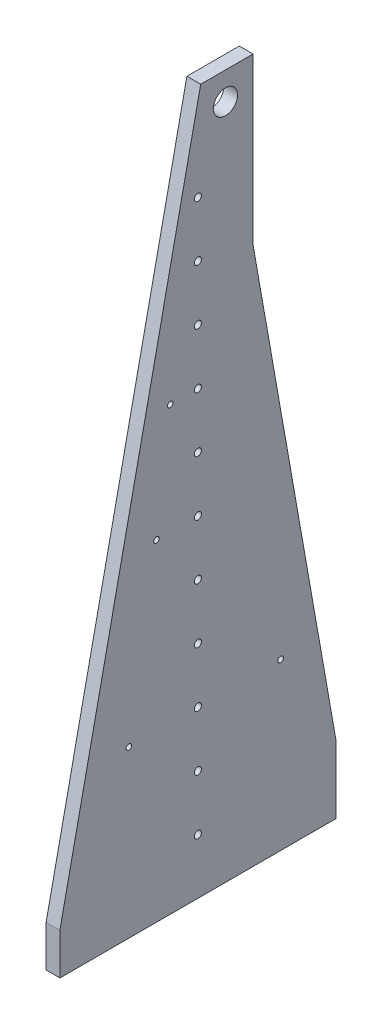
from build123d import *

# Parameters (mm, degrees)
BOSS_EXTRUDE1_DEPTH                              = 12.7
F_7_8_0_875_DIAMETER_HOLE1_D                     = 22.225
F_1_4_20_TAPPED_HOLE2_D                          = 5.1054
F_1_4_20_TAPPED_HOLE1_D                          = 5.1054
F_1_4_20_TAPPED_HOLE1_DEPTH                      = 13.335
F_1_4_20_TAPPED_HOLE1_TIP                        = 1.533816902
CBORE_FOR_1_4_SOCKET_HEAD_CAP_SCREW1_D           = 6.5278
CBORE_FOR_1_4_SOCKET_HEAD_CAP_SCREW1_CBORE_D     = 11.1125
CBORE_FOR_1_4_SOCKET_HEAD_CAP_SCREW1_CBORE_DEPTH = 6.35
LPATTERN1_COUNT                                  = 11
LPATTERN1_PITCH                                  = 50.8
FILLET1_R                                        = 9.652


with BuildPart() as part:
    # Sketch1 → Boss-Extrude1 (new body)
    with BuildSketch(Plane(origin=(0, 0, 0), x_dir=(0, 0, -1), z_dir=(1, 0, 0))):
        Polygon((2.574479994, 647.7), (50.8, 647.7), (50.8, 495.3), (127, 63.148325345), (127, 0), (-127, 0), (-127, 38.1), align=None)
    extrude(amount=BOSS_EXTRUDE1_DEPTH)

    # 7_8 _0.875_ Diameter Hole1 (through all)
    with Locations(Plane(origin=(12.7, 0, 0), x_dir=(0, 0, -1), z_dir=(1, 0, 0))):
        with Locations((25.4, 622.3)):
            Hole(F_7_8_0_875_DIAMETER_HOLE1_D / 2)

    # 1_4-20 Tapped Hole2 (through all)
    with Locations(Plane(origin=(12.7, 0, 0), x_dir=(0, 0, -1), z_dir=(1, 0, 0))):
        with Locations((-25.4, 406.4), (-38.1, 304.8), (-63.5, 152.4), (76.2, 152.4)):
            Hole(F_1_4_20_TAPPED_HOLE2_D / 2)

    # 1_4-20 Tapped Hole1
    with Locations(Plane(origin=(0, 0, 0), x_dir=(-1, 0, 0), z_dir=(0, -1, 0))):
        with Locations((-6.35, 101.6), (-6.35, 50.8), (-6.35, 0), (-6.35, -50.8), (-6.35, -101.6)):
            Hole(F_1_4_20_TAPPED_HOLE1_D / 2, depth=F_1_4_20_TAPPED_HOLE1_DEPTH)
            with Locations((0, 0, -(F_1_4_20_TAPPED_HOLE1_DEPTH + F_1_4_20_TAPPED_HOLE1_TIP / 2))):  # 118° drill point
                Cone(0, F_1_4_20_TAPPED_HOLE1_D / 2, F_1_4_20_TAPPED_HOLE1_TIP, mode=Mode.SUBTRACT)

    # CBORE for 1_4 Socket Head Cap Screw1 (through all)
    with Locations(Plane.ZY):
        with Locations((0, 50.8)):
            cbore_for_1_4_socket_head_cap_screw1 = CounterBoreHole(CBORE_FOR_1_4_SOCKET_HEAD_CAP_SCREW1_D / 2, CBORE_FOR_1_4_SOCKET_HEAD_CAP_SCREW1_CBORE_D / 2, CBORE_FOR_1_4_SOCKET_HEAD_CAP_SCREW1_CBORE_DEPTH)

    # LPattern1: CBORE for 1_4 Socket Head Cap Screw1 ×11
    with Locations(*[(0, i * LPATTERN1_PITCH, 0) for i in range(1, LPATTERN1_COUNT)]):
        add(cbore_for_1_4_socket_head_cap_screw1, mode=Mode.SUBTRACT)

    # Fillet1
    fillet1_edges = [part.edges().sort_by_distance(p)[0] for p in [
        (6.35, 495.3, -50.8),
    ]]
    fillet(fillet1_edges, radius=FILLET1_R)


solid = part.part
